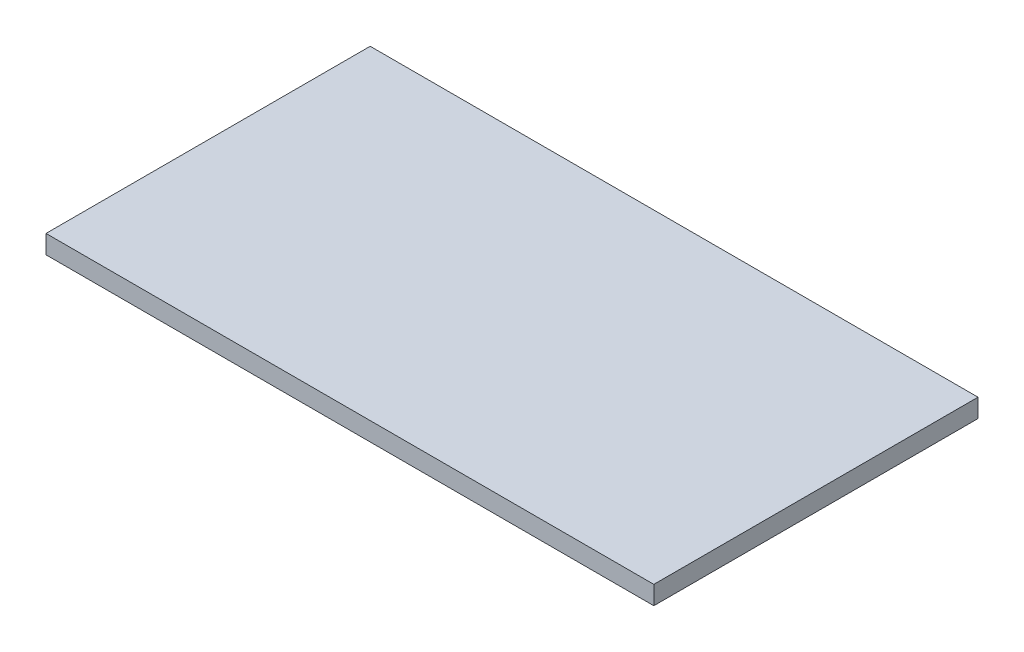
from build123d import *

# Parameters (mm, degrees)
BOSS_EXTRUDE1_START = 25
SKETCH1_W           = 600
SKETCH1_H           = 18.296291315
BOSS_EXTRUDE1_DEPTH = 320


with BuildPart() as part:
    # Sketch1 → Boss-Extrude1 (new body)
    with BuildSketch(Plane.XY.offset(BOSS_EXTRUDE1_START)):
        with Locations((0, 340.315477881)):
            Rectangle(SKETCH1_W, SKETCH1_H)
    extrude(amount=BOSS_EXTRUDE1_DEPTH)


solid = part.part
